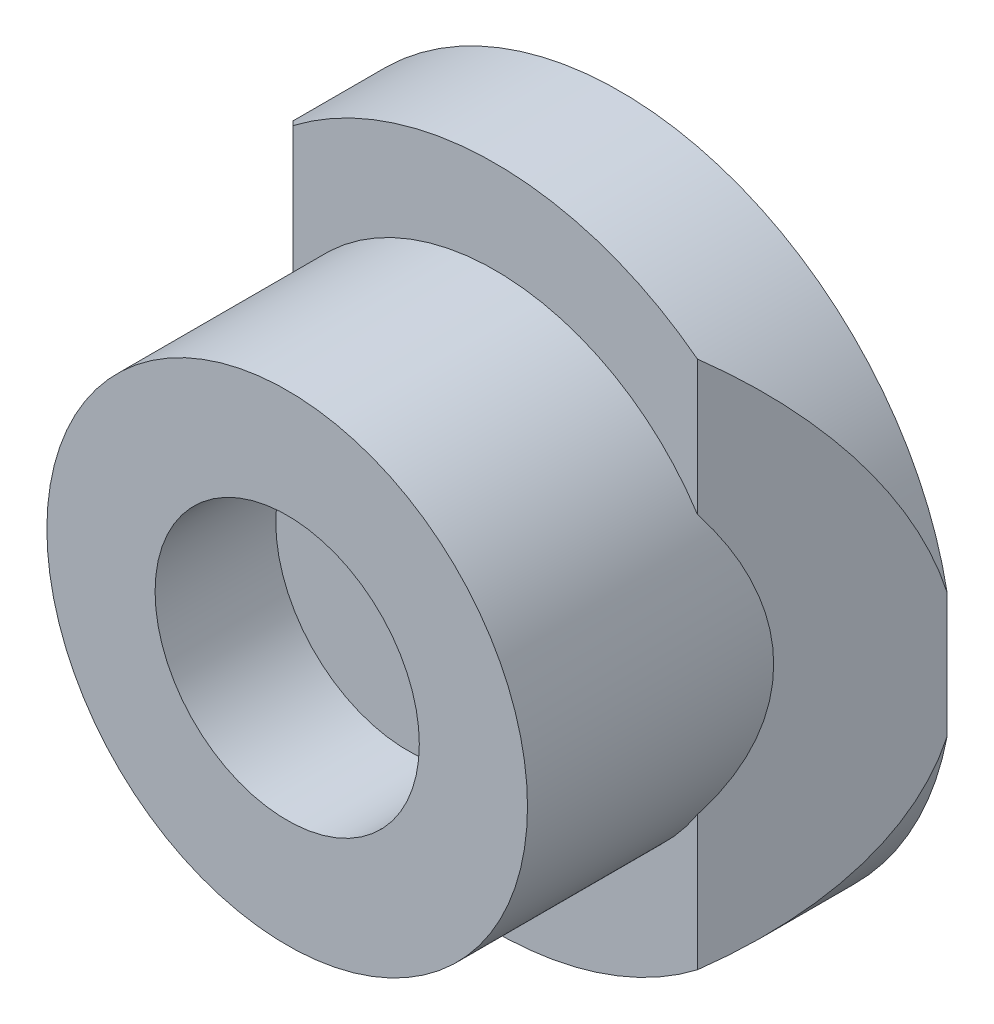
from build123d import *

# Parameters (mm, degrees)
SKETCH2_R               = 5.775
BOSS_EXTRUDE1_DEPTH     = 5
SKETCH3_R               = 8
BOSS_EXTRUDE2_DEPTH     = 3
SKETCH4_R               = 3.175
CUT_EXTRUDE1_DEPTH      = 2.9
CUT_EXTRUDE2_DEPTH      = 13.369316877
CUT_EXTRUDE2_DEPTH_BACK = 13.369316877
BOSS_EXTRUDE3_START     = -2
SKETCH7_R               = 5.775
BOSS_EXTRUDE3_DEPTH     = 2


with BuildPart() as part:
    # Sketch2 → Boss-Extrude1 (new body)
    with BuildSketch(Plane.XY):
        Circle(SKETCH2_R)
    extrude(amount=BOSS_EXTRUDE1_DEPTH)

    # Sketch3 → Boss-Extrude2 (add)
    with BuildSketch(Plane.XY):
        Circle(SKETCH3_R)
    extrude(amount=-BOSS_EXTRUDE2_DEPTH)

    # Sketch4 → Cut-Extrude1 (cut)
    with BuildSketch(Plane.XY.offset(5)):
        Circle(SKETCH4_R)
    extrude(amount=-CUT_EXTRUDE1_DEPTH, mode=Mode.SUBTRACT)

    # Sketch5 → Cut-Extrude2 (cut, two sides: drawn at the far end of the back side and taken through both)
    with BuildSketch(Plane(origin=(0, 0, 0), x_dir=(1, 0, 0), z_dir=(0, 1, 0)).offset(-CUT_EXTRUDE2_DEPTH_BACK)):
        Polygon((-8, 3), (-8, 0), (-5, 0), (-4.858578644, 0), (-7.858578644, 3), align=None)
        Polygon((8, 3), (8, 0), (5, 0), (4.858578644, 0), (7.858578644, 3), align=None)
    extrude(amount=CUT_EXTRUDE2_DEPTH + CUT_EXTRUDE2_DEPTH_BACK, mode=Mode.SUBTRACT)

    # Sketch7 → Boss-Extrude3 (add)
    with BuildSketch(Plane.XY.offset(BOSS_EXTRUDE3_START)):
        with Locations(Location((0, 0, 0), (0, 0, 147.278957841))):
            Circle(SKETCH7_R)
    extrude(amount=BOSS_EXTRUDE3_DEPTH)


solid = part.part
